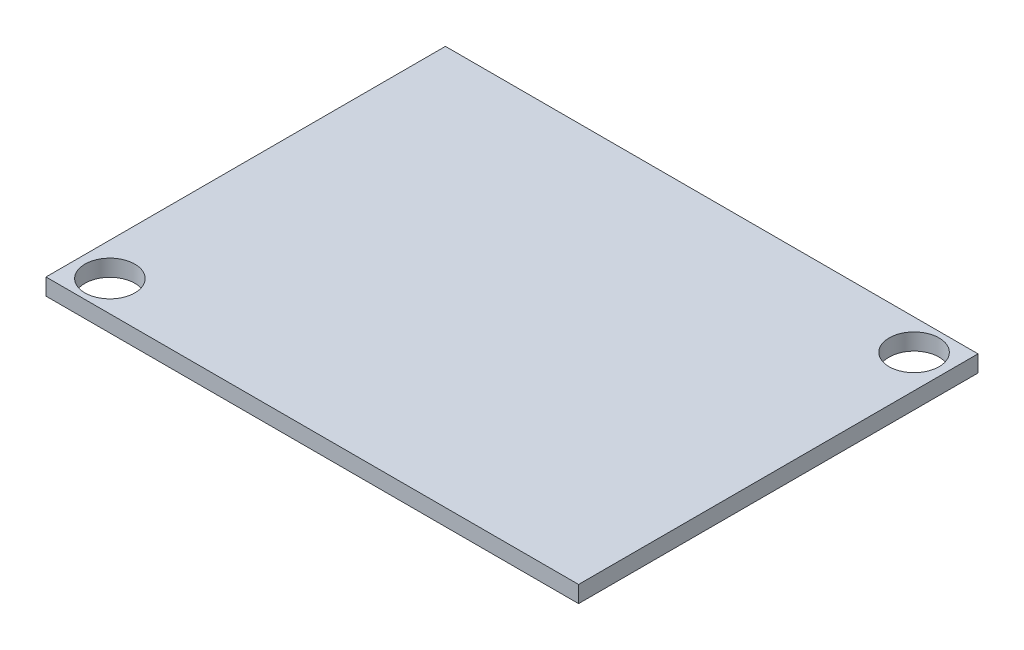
ISO-10303-21;
HEADER;
FILE_DESCRIPTION(('STEP AP214'),'2;1');
FILE_NAME('part.step','',(''),(''),'','','');
FILE_SCHEMA(('AUTOMOTIVE_DESIGN { 1 0 10303 214 1 1 1 1 }'));
ENDSEC;
DATA;
#1=APPLICATION_CONTEXT('core data for automotive mechanical design processes');
#2=APPLICATION_PROTOCOL_DEFINITION('international standard','automotive_design',2000,#1);
#3=PRODUCT_CONTEXT('',#1,'mechanical');
#4=PRODUCT('Part','Part','',(#3));
#5=PRODUCT_RELATED_PRODUCT_CATEGORY('part','',(#4));
#6=PRODUCT_DEFINITION_FORMATION('','',#4);
#7=PRODUCT_DEFINITION_CONTEXT('part definition',#1,'design');
#8=PRODUCT_DEFINITION('design','',#6,#7);
#9=PRODUCT_DEFINITION_SHAPE('','',#8);
#10=(LENGTH_UNIT() NAMED_UNIT(*) SI_UNIT(.MILLI.,.METRE.));
#11=(NAMED_UNIT(*) PLANE_ANGLE_UNIT() SI_UNIT($,.RADIAN.));
#12=(NAMED_UNIT(*) SI_UNIT($,.STERADIAN.) SOLID_ANGLE_UNIT());
#13=UNCERTAINTY_MEASURE_WITH_UNIT(LENGTH_MEASURE(1.E-05),#10,'distance_accuracy_value','');
#14=(GEOMETRIC_REPRESENTATION_CONTEXT(3) GLOBAL_UNCERTAINTY_ASSIGNED_CONTEXT((#13)) GLOBAL_UNIT_ASSIGNED_CONTEXT((#10,
#11,#12)) REPRESENTATION_CONTEXT('',''));
#15=CARTESIAN_POINT('',(0.,0.,0.));
#16=DIRECTION('',(0.,0.,1.));
#17=DIRECTION('',(1.,0.,0.));
#18=AXIS2_PLACEMENT_3D('',#15,#16,#17);
#19=CARTESIAN_POINT('',(-44.8319270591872,3.175,-51.2954257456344));
#20=DIRECTION('',(1.,0.,0.));
#21=DIRECTION('',(0.,0.,-1.));
#22=AXIS2_PLACEMENT_3D('',#19,#20,#21);
#23=PLANE('',#22);
#24=DIRECTION('',(0.,0.,1.));
#25=VECTOR('',#24,1.);
#26=CARTESIAN_POINT('',(-44.8319270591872,0.,-51.2954257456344));
#27=LINE('',#26,#25);
#28=CARTESIAN_POINT('',(-44.8319270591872,0.,-51.2954257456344));
#29=VERTEX_POINT('',#28);
#30=CARTESIAN_POINT('',(-44.8319270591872,0.,24.9045742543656));
#31=VERTEX_POINT('',#30);
#32=EDGE_CURVE('E76',#29,#31,#27,.T.);
#33=ORIENTED_EDGE('',*,*,#32,.T.);
#34=DIRECTION('',(0.,-1.,0.));
#35=VECTOR('',#34,1.);
#36=CARTESIAN_POINT('',(-44.8319270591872,3.175,24.9045742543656));
#37=LINE('',#36,#35);
#38=CARTESIAN_POINT('',(-44.8319270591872,3.175,24.9045742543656));
#39=VERTEX_POINT('',#38);
#40=EDGE_CURVE('E11',#39,#31,#37,.T.);
#41=ORIENTED_EDGE('',*,*,#40,.F.);
#42=DIRECTION('',(0.,0.,1.));
#43=VECTOR('',#42,1.);
#44=CARTESIAN_POINT('',(-44.8319270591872,3.175,-51.2954257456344));
#45=LINE('',#44,#43);
#46=CARTESIAN_POINT('',(-44.8319270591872,3.175,-51.2954257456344));
#47=VERTEX_POINT('',#46);
#48=EDGE_CURVE('E99',#47,#39,#45,.T.);
#49=ORIENTED_EDGE('',*,*,#48,.F.);
#50=DIRECTION('',(0.,-1.,0.));
#51=VECTOR('',#50,1.);
#52=CARTESIAN_POINT('',(-44.8319270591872,3.175,-51.2954257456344));
#53=LINE('',#52,#51);
#54=EDGE_CURVE('E88',#47,#29,#53,.T.);
#55=ORIENTED_EDGE('',*,*,#54,.T.);
#56=EDGE_LOOP('',(#33,#41,#49,#55));
#57=FACE_BOUND('',#56,.T.);
#58=ADVANCED_FACE('F32',(#57),#23,.F.);
#59=CARTESIAN_POINT('',(-44.8319270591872,3.175,24.9045742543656));
#60=DIRECTION('',(0.,0.,-1.));
#61=DIRECTION('',(-1.,0.,0.));
#62=AXIS2_PLACEMENT_3D('',#59,#60,#61);
#63=PLANE('',#62);
#64=DIRECTION('',(1.,0.,0.));
#65=VECTOR('',#64,1.);
#66=CARTESIAN_POINT('',(-44.8319270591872,0.,24.9045742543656));
#67=LINE('',#66,#65);
#68=CARTESIAN_POINT('',(56.7680729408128,0.,24.9045742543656));
#69=VERTEX_POINT('',#68);
#70=EDGE_CURVE('E72',#31,#69,#67,.T.);
#71=ORIENTED_EDGE('',*,*,#70,.T.);
#72=DIRECTION('',(0.,-1.,0.));
#73=VECTOR('',#72,1.);
#74=CARTESIAN_POINT('',(56.7680729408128,3.175,24.9045742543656));
#75=LINE('',#74,#73);
#76=CARTESIAN_POINT('',(56.7680729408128,3.175,24.9045742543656));
#77=VERTEX_POINT('',#76);
#78=EDGE_CURVE('E39',#77,#69,#75,.T.);
#79=ORIENTED_EDGE('',*,*,#78,.F.);
#80=DIRECTION('',(1.,0.,0.));
#81=VECTOR('',#80,1.);
#82=CARTESIAN_POINT('',(-44.8319270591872,3.175,24.9045742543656));
#83=LINE('',#82,#81);
#84=EDGE_CURVE('E84',#39,#77,#83,.T.);
#85=ORIENTED_EDGE('',*,*,#84,.F.);
#86=ORIENTED_EDGE('',*,*,#40,.T.);
#87=EDGE_LOOP('',(#71,#79,#85,#86));
#88=FACE_BOUND('',#87,.T.);
#89=ADVANCED_FACE('F83',(#88),#63,.F.);
#90=CARTESIAN_POINT('',(56.7680729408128,3.175,-51.2954257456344));
#91=DIRECTION('',(-1.,0.,0.));
#92=DIRECTION('',(0.,0.,1.));
#93=AXIS2_PLACEMENT_3D('',#90,#91,#92);
#94=PLANE('',#93);
#95=DIRECTION('',(0.,0.,-1.));
#96=VECTOR('',#95,1.);
#97=CARTESIAN_POINT('',(56.7680729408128,0.,-51.2954257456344));
#98=LINE('',#97,#96);
#99=CARTESIAN_POINT('',(56.7680729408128,0.,-51.2954257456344));
#100=VERTEX_POINT('',#99);
#101=EDGE_CURVE('E77',#69,#100,#98,.T.);
#102=ORIENTED_EDGE('',*,*,#101,.T.);
#103=DIRECTION('',(0.,-1.,0.));
#104=VECTOR('',#103,1.);
#105=CARTESIAN_POINT('',(56.7680729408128,3.175,-51.2954257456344));
#106=LINE('',#105,#104);
#107=CARTESIAN_POINT('',(56.7680729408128,3.175,-51.2954257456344));
#108=VERTEX_POINT('',#107);
#109=EDGE_CURVE('E105',#108,#100,#106,.T.);
#110=ORIENTED_EDGE('',*,*,#109,.F.);
#111=DIRECTION('',(0.,0.,-1.));
#112=VECTOR('',#111,1.);
#113=CARTESIAN_POINT('',(56.7680729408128,3.175,-51.2954257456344));
#114=LINE('',#113,#112);
#115=EDGE_CURVE('E51',#77,#108,#114,.T.);
#116=ORIENTED_EDGE('',*,*,#115,.F.);
#117=ORIENTED_EDGE('',*,*,#78,.T.);
#118=EDGE_LOOP('',(#102,#110,#116,#117));
#119=FACE_BOUND('',#118,.T.);
#120=ADVANCED_FACE('F108',(#119),#94,.F.);
#121=CARTESIAN_POINT('',(-44.8319270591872,3.175,-51.2954257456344));
#122=DIRECTION('',(0.,0.,1.));
#123=DIRECTION('',(1.,0.,0.));
#124=AXIS2_PLACEMENT_3D('',#121,#122,#123);
#125=PLANE('',#124);
#126=DIRECTION('',(-1.,0.,0.));
#127=VECTOR('',#126,1.);
#128=CARTESIAN_POINT('',(-44.8319270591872,0.,-51.2954257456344));
#129=LINE('',#128,#127);
#130=EDGE_CURVE('E97',#100,#29,#129,.T.);
#131=ORIENTED_EDGE('',*,*,#130,.T.);
#132=ORIENTED_EDGE('',*,*,#54,.F.);
#133=DIRECTION('',(-1.,0.,0.));
#134=VECTOR('',#133,1.);
#135=CARTESIAN_POINT('',(-44.8319270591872,3.175,-51.2954257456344));
#136=LINE('',#135,#134);
#137=EDGE_CURVE('E46',#108,#47,#136,.T.);
#138=ORIENTED_EDGE('',*,*,#137,.F.);
#139=ORIENTED_EDGE('',*,*,#109,.T.);
#140=EDGE_LOOP('',(#131,#132,#138,#139));
#141=FACE_BOUND('',#140,.T.);
#142=ADVANCED_FACE('F110',(#141),#125,.F.);
#143=CARTESIAN_POINT('',(-44.8319270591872,3.175,24.9045742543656));
#144=DIRECTION('',(0.,1.,0.));
#145=DIRECTION('',(0.,0.,1.));
#146=AXIS2_PLACEMENT_3D('',#143,#144,#145);
#147=PLANE('',#146);
#148=CARTESIAN_POINT('',(-38.4819270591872,3.175,19.0625742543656));
#149=DIRECTION('',(0.,1.,0.));
#150=DIRECTION('',(0.,0.,1.));
#151=AXIS2_PLACEMENT_3D('',#148,#149,#150);
#152=CIRCLE('',#151,4.7625);
#153=CARTESIAN_POINT('',(-38.4819270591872,3.175,23.8250742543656));
#154=VERTEX_POINT('',#153);
#155=EDGE_CURVE('E177',#154,#154,#152,.T.);
#156=ORIENTED_EDGE('',*,*,#155,.F.);
#157=EDGE_LOOP('',(#156));
#158=FACE_BOUND('',#157,.T.);
#159=CARTESIAN_POINT('',(50.4180729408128,3.175,-45.4534257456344));
#160=DIRECTION('',(0.,1.,0.));
#161=DIRECTION('',(0.,0.,1.));
#162=AXIS2_PLACEMENT_3D('',#159,#160,#161);
#163=CIRCLE('',#162,4.7625);
#164=CARTESIAN_POINT('',(50.4180729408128,3.175,-40.6909257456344));
#165=VERTEX_POINT('',#164);
#166=EDGE_CURVE('E92',#165,#165,#163,.T.);
#167=ORIENTED_EDGE('',*,*,#166,.F.);
#168=EDGE_LOOP('',(#167));
#169=FACE_BOUND('',#168,.T.);
#170=ORIENTED_EDGE('',*,*,#48,.T.);
#171=ORIENTED_EDGE('',*,*,#84,.T.);
#172=ORIENTED_EDGE('',*,*,#115,.T.);
#173=ORIENTED_EDGE('',*,*,#137,.T.);
#174=EDGE_LOOP('',(#170,#171,#172,#173));
#175=FACE_BOUND('',#174,.T.);
#176=ADVANCED_FACE('F111',(#158,#169,#175),#147,.T.);
#177=CARTESIAN_POINT('',(-44.8319270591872,0.,24.9045742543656));
#178=DIRECTION('',(0.,1.,0.));
#179=DIRECTION('',(0.,0.,1.));
#180=AXIS2_PLACEMENT_3D('',#177,#178,#179);
#181=PLANE('',#180);
#182=CARTESIAN_POINT('',(-38.4819270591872,0.,19.0625742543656));
#183=DIRECTION('',(0.,1.,0.));
#184=DIRECTION('',(0.,0.,1.));
#185=AXIS2_PLACEMENT_3D('',#182,#183,#184);
#186=CIRCLE('',#185,4.7625);
#187=CARTESIAN_POINT('',(-38.4819270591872,0.,23.8250742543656));
#188=VERTEX_POINT('',#187);
#189=EDGE_CURVE('E175',#188,#188,#186,.T.);
#190=ORIENTED_EDGE('',*,*,#189,.T.);
#191=EDGE_LOOP('',(#190));
#192=FACE_BOUND('',#191,.T.);
#193=CARTESIAN_POINT('',(50.4180729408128,0.,-45.4534257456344));
#194=DIRECTION('',(0.,1.,0.));
#195=DIRECTION('',(0.,0.,1.));
#196=AXIS2_PLACEMENT_3D('',#193,#194,#195);
#197=CIRCLE('',#196,4.7625);
#198=CARTESIAN_POINT('',(50.4180729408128,0.,-40.6909257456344));
#199=VERTEX_POINT('',#198);
#200=EDGE_CURVE('E89',#199,#199,#197,.T.);
#201=ORIENTED_EDGE('',*,*,#200,.T.);
#202=EDGE_LOOP('',(#201));
#203=FACE_BOUND('',#202,.T.);
#204=ORIENTED_EDGE('',*,*,#32,.F.);
#205=ORIENTED_EDGE('',*,*,#130,.F.);
#206=ORIENTED_EDGE('',*,*,#101,.F.);
#207=ORIENTED_EDGE('',*,*,#70,.F.);
#208=EDGE_LOOP('',(#204,#205,#206,#207));
#209=FACE_BOUND('',#208,.T.);
#210=ADVANCED_FACE('F73',(#192,#203,#209),#181,.F.);
#211=CARTESIAN_POINT('',(50.4180729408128,0.,-45.4534257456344));
#212=DIRECTION('',(0.,1.,0.));
#213=DIRECTION('',(0.,0.,1.));
#214=AXIS2_PLACEMENT_3D('',#211,#212,#213);
#215=CYLINDRICAL_SURFACE('',#214,4.7625);
#216=ORIENTED_EDGE('',*,*,#200,.F.);
#217=EDGE_LOOP('',(#216));
#218=FACE_BOUND('',#217,.T.);
#219=ORIENTED_EDGE('',*,*,#166,.T.);
#220=EDGE_LOOP('',(#219));
#221=FACE_BOUND('',#220,.T.);
#222=ADVANCED_FACE('F119',(#218,#221),#215,.F.);
#223=CARTESIAN_POINT('',(-38.4819270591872,0.,19.0625742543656));
#224=DIRECTION('',(0.,1.,0.));
#225=DIRECTION('',(0.,0.,1.));
#226=AXIS2_PLACEMENT_3D('',#223,#224,#225);
#227=CYLINDRICAL_SURFACE('',#226,4.7625);
#228=ORIENTED_EDGE('',*,*,#189,.F.);
#229=EDGE_LOOP('',(#228));
#230=FACE_BOUND('',#229,.T.);
#231=ORIENTED_EDGE('',*,*,#155,.T.);
#232=EDGE_LOOP('',(#231));
#233=FACE_BOUND('',#232,.T.);
#234=ADVANCED_FACE('F158',(#230,#233),#227,.F.);
#235=CLOSED_SHELL('',(#58,#89,#120,#142,#176,#210,#222,#234));
#236=MANIFOLD_SOLID_BREP('B2',#235);
#237=ADVANCED_BREP_SHAPE_REPRESENTATION('',(#18,#236),#14);
#238=SHAPE_DEFINITION_REPRESENTATION(#9,#237);
ENDSEC;
END-ISO-10303-21;
